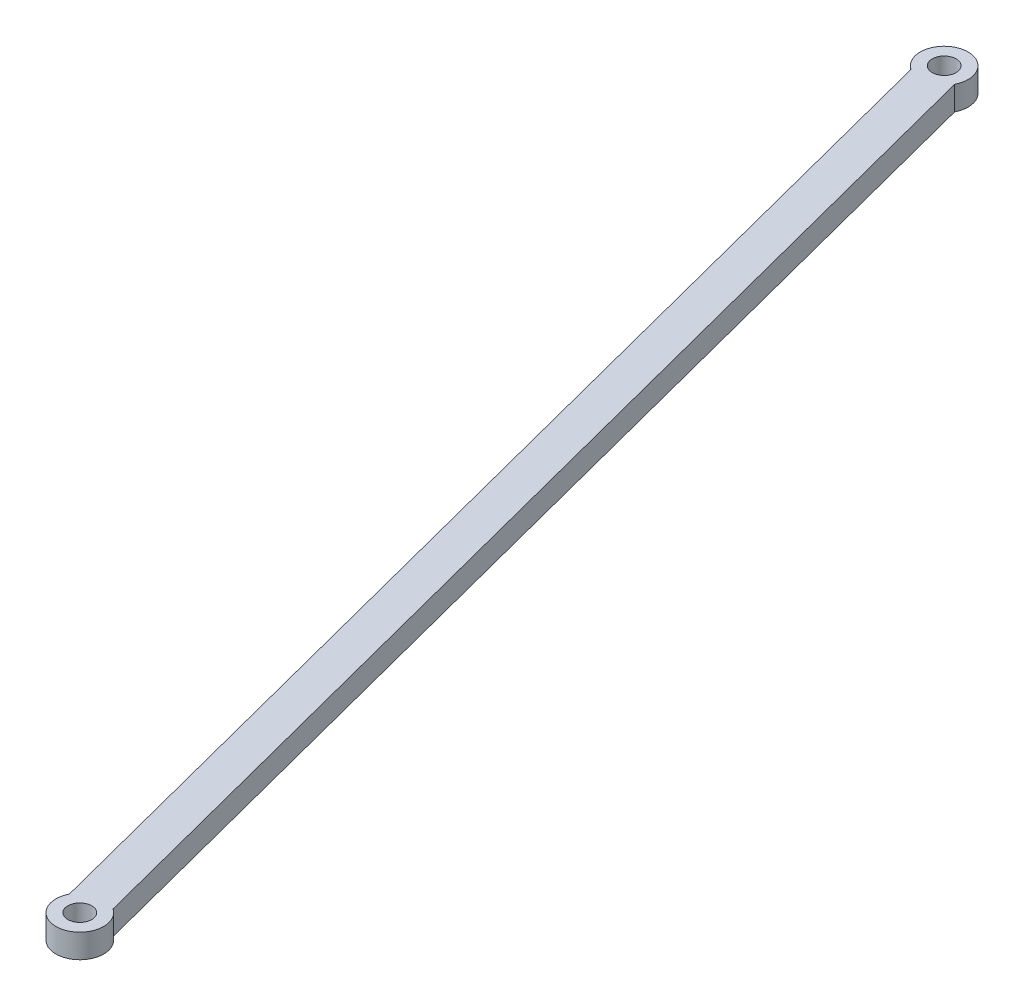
from build123d import *

# Parameters (mm, degrees)
SKIZZE2_R                       = 10
AUFSATZ_LINEAR_AUSTRAGEN1_DEPTH = 20


with BuildPart() as part:
    # Skizze2 → Aufsatz-Linear austragen1 (new body)
    with BuildSketch(Plane(origin=(0, 400, 0), x_dir=(1, 0, 0), z_dir=(0, 1, 0))):
        with BuildLine():
            Line((-137.212420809, -599.061449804), (108.156966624, -1548.40724155))
            ThreePointArc((108.156966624, -1548.40724155), (130.994841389, -1576.82522421), (137.202494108, -1540.900089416))
            Line((137.202494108, -1540.900089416), (-108.166893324, -591.55429767))
            ThreePointArc((-108.166893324, -591.55429767), (-131.004768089, -563.136315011), (-137.212420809, -599.061449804))
        make_face()
        with Locations(Location((-126, -582.5, 0), (0, 0, 270))):
            Circle(SKIZZE2_R, mode=Mode.SUBTRACT)
        with Locations(Location((125.9900733, -1557.46153922, 0), (0, 0, 270))):
            Circle(SKIZZE2_R, mode=Mode.SUBTRACT)
    extrude(amount=AUFSATZ_LINEAR_AUSTRAGEN1_DEPTH)


solid = part.part
